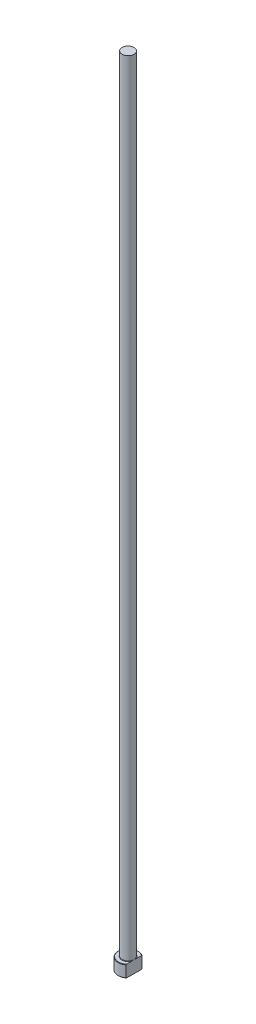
ISO-10303-21;
HEADER;
FILE_DESCRIPTION(('STEP AP214'),'2;1');
FILE_NAME('part.step','',(''),(''),'','','');
FILE_SCHEMA(('AUTOMOTIVE_DESIGN { 1 0 10303 214 1 1 1 1 }'));
ENDSEC;
DATA;
#1=APPLICATION_CONTEXT('core data for automotive mechanical design processes');
#2=APPLICATION_PROTOCOL_DEFINITION('international standard','automotive_design',2000,#1);
#3=PRODUCT_CONTEXT('',#1,'mechanical');
#4=PRODUCT('Part','Part','',(#3));
#5=PRODUCT_RELATED_PRODUCT_CATEGORY('part','',(#4));
#6=PRODUCT_DEFINITION_FORMATION('','',#4);
#7=PRODUCT_DEFINITION_CONTEXT('part definition',#1,'design');
#8=PRODUCT_DEFINITION('design','',#6,#7);
#9=PRODUCT_DEFINITION_SHAPE('','',#8);
#10=(LENGTH_UNIT() NAMED_UNIT(*) SI_UNIT(.MILLI.,.METRE.));
#11=(NAMED_UNIT(*) PLANE_ANGLE_UNIT() SI_UNIT($,.RADIAN.));
#12=(NAMED_UNIT(*) SI_UNIT($,.STERADIAN.) SOLID_ANGLE_UNIT());
#13=UNCERTAINTY_MEASURE_WITH_UNIT(LENGTH_MEASURE(1.E-05),#10,'distance_accuracy_value','');
#14=(GEOMETRIC_REPRESENTATION_CONTEXT(3) GLOBAL_UNCERTAINTY_ASSIGNED_CONTEXT((#13)) GLOBAL_UNIT_ASSIGNED_CONTEXT((#10,
#11,#12)) REPRESENTATION_CONTEXT('',''));
#15=CARTESIAN_POINT('',(0.,0.,0.));
#16=DIRECTION('',(0.,0.,1.));
#17=DIRECTION('',(1.,0.,0.));
#18=AXIS2_PLACEMENT_3D('',#15,#16,#17);
#19=CARTESIAN_POINT('',(0.,0.,0.));
#20=DIRECTION('',(0.,-1.,0.));
#21=DIRECTION('',(0.,0.,-1.));
#22=AXIS2_PLACEMENT_3D('',#19,#20,#21);
#23=PLANE('',#22);
#24=CARTESIAN_POINT('',(0.,0.,0.));
#25=DIRECTION('',(0.,-1.,0.));
#26=DIRECTION('',(0.,0.,-1.));
#27=AXIS2_PLACEMENT_3D('',#24,#25,#26);
#28=CIRCLE('',#27,4.79999999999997);
#29=CARTESIAN_POINT('',(2.99999999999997,0.,3.74699879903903));
#30=VERTEX_POINT('',#29);
#31=CARTESIAN_POINT('',(2.99999999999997,0.,-3.74699879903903));
#32=VERTEX_POINT('',#31);
#33=EDGE_CURVE('E98',#30,#32,#28,.T.);
#34=ORIENTED_EDGE('',*,*,#33,.T.);
#35=DIRECTION('',(0.,0.,1.));
#36=VECTOR('',#35,1.);
#37=CARTESIAN_POINT('',(2.99999999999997,0.,3.99999999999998));
#38=LINE('',#37,#36);
#39=EDGE_CURVE('E83',#32,#30,#38,.T.);
#40=ORIENTED_EDGE('',*,*,#39,.T.);
#41=EDGE_LOOP('',(#34,#40));
#42=FACE_BOUND('',#41,.T.);
#43=ADVANCED_FACE('F32',(#42),#23,.T.);
#44=CARTESIAN_POINT('',(0.,259.958771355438,0.));
#45=DIRECTION('',(0.,1.,0.));
#46=DIRECTION('',(0.,0.,1.));
#47=AXIS2_PLACEMENT_3D('',#44,#45,#46);
#48=CYLINDRICAL_SURFACE('',#47,4.99999999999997);
#49=CARTESIAN_POINT('',(0.,5.80000000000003,0.));
#50=DIRECTION('',(0.,1.,0.));
#51=DIRECTION('',(0.,0.,1.));
#52=AXIS2_PLACEMENT_3D('',#49,#50,#51);
#53=CIRCLE('',#52,4.99999999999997);
#54=CARTESIAN_POINT('',(2.99999999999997,5.80000000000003,3.99999999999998));
#55=VERTEX_POINT('',#54);
#56=CARTESIAN_POINT('',(2.99999999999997,5.80000000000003,-3.99999999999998));
#57=VERTEX_POINT('',#56);
#58=EDGE_CURVE('E104',#55,#57,#53,.F.);
#59=ORIENTED_EDGE('',*,*,#58,.T.);
#60=DIRECTION('',(0.,-1.,0.));
#61=VECTOR('',#60,1.);
#62=CARTESIAN_POINT('',(2.99999999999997,400.,-3.99999999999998));
#63=LINE('',#62,#61);
#64=CARTESIAN_POINT('',(2.99999999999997,0.199999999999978,-3.99999999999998));
#65=VERTEX_POINT('',#64);
#66=EDGE_CURVE('E183',#57,#65,#63,.T.);
#67=ORIENTED_EDGE('',*,*,#66,.T.);
#68=CARTESIAN_POINT('',(0.,0.199999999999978,0.));
#69=DIRECTION('',(0.,-1.,0.));
#70=DIRECTION('',(0.,0.,-1.));
#71=AXIS2_PLACEMENT_3D('',#68,#69,#70);
#72=CIRCLE('',#71,4.99999999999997);
#73=CARTESIAN_POINT('',(2.99999999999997,0.199999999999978,3.99999999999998));
#74=VERTEX_POINT('',#73);
#75=EDGE_CURVE('E100',#65,#74,#72,.F.);
#76=ORIENTED_EDGE('',*,*,#75,.T.);
#77=DIRECTION('',(0.,-1.,0.));
#78=VECTOR('',#77,1.);
#79=CARTESIAN_POINT('',(2.99999999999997,400.,3.99999999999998));
#80=LINE('',#79,#78);
#81=EDGE_CURVE('E93',#55,#74,#80,.T.);
#82=ORIENTED_EDGE('',*,*,#81,.F.);
#83=EDGE_LOOP('',(#59,#67,#76,#82));
#84=FACE_BOUND('',#83,.T.);
#85=ADVANCED_FACE('F158',(#84),#48,.T.);
#86=CARTESIAN_POINT('',(-4.99999999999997,6.,0.));
#87=DIRECTION('',(0.,1.,0.));
#88=DIRECTION('',(0.,0.,1.));
#89=AXIS2_PLACEMENT_3D('',#86,#87,#88);
#90=PLANE('',#89);
#91=CARTESIAN_POINT('',(0.,6.,0.));
#92=DIRECTION('',(0.,1.,0.));
#93=DIRECTION('',(0.,0.,1.));
#94=AXIS2_PLACEMENT_3D('',#91,#92,#93);
#95=CIRCLE('',#94,4.79999999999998);
#96=CARTESIAN_POINT('',(2.99999999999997,6.,-3.74699879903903));
#97=VERTEX_POINT('',#96);
#98=CARTESIAN_POINT('',(2.99999999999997,6.,3.74699879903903));
#99=VERTEX_POINT('',#98);
#100=EDGE_CURVE('E178',#97,#99,#95,.T.);
#101=ORIENTED_EDGE('',*,*,#100,.T.);
#102=DIRECTION('',(0.,0.,-1.));
#103=VECTOR('',#102,1.);
#104=CARTESIAN_POINT('',(2.99999999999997,6.,0.));
#105=LINE('',#104,#103);
#106=CARTESIAN_POINT('',(2.99999999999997,5.99999999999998,1.11355287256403));
#107=VERTEX_POINT('',#106);
#108=EDGE_CURVE('E57',#99,#107,#105,.T.);
#109=ORIENTED_EDGE('',*,*,#108,.T.);
#110=CARTESIAN_POINT('',(0.,6.,0.));
#111=DIRECTION('',(0.,1.,0.));
#112=DIRECTION('',(0.,0.,1.));
#113=AXIS2_PLACEMENT_3D('',#110,#111,#112);
#114=CIRCLE('',#113,3.19999999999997);
#115=CARTESIAN_POINT('',(2.99999999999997,5.99999999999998,-1.113552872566));
#116=VERTEX_POINT('',#115);
#117=EDGE_CURVE('E107',#107,#116,#114,.F.);
#118=ORIENTED_EDGE('',*,*,#117,.T.);
#119=EDGE_CURVE('E136',#116,#97,#105,.T.);
#120=ORIENTED_EDGE('',*,*,#119,.T.);
#121=EDGE_LOOP('',(#101,#109,#118,#120));
#122=FACE_BOUND('',#121,.T.);
#123=ADVANCED_FACE('F147',(#122),#90,.T.);
#124=CARTESIAN_POINT('',(0.,6.00000000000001,0.));
#125=DIRECTION('',(0.,-1.,0.));
#126=DIRECTION('',(0.,0.,-1.));
#127=AXIS2_PLACEMENT_3D('',#124,#125,#126);
#128=CONICAL_SURFACE('',#127,4.79999999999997,0.785398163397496);
#129=ORIENTED_EDGE('',*,*,#58,.F.);
#130=CARTESIAN_POINT('',(2.99999999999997,1.50107969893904,8.80169976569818));
#131=CARTESIAN_POINT('',(2.99999999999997,1.63686222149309,8.65824370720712));
#132=CARTESIAN_POINT('',(2.99999999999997,1.77246571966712,8.51461803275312));
#133=CARTESIAN_POINT('',(2.99999999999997,2.04325136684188,8.22696847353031));
#134=CARTESIAN_POINT('',(2.99999999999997,2.17843351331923,8.0829445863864));
#135=CARTESIAN_POINT('',(2.99999999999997,2.58356488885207,7.6498536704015));
#136=CARTESIAN_POINT('',(2.99999999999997,2.85278243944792,7.3601013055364));
#137=CARTESIAN_POINT('',(2.99999999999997,3.40003551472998,6.76562093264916));
#138=CARTESIAN_POINT('',(2.99999999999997,3.67795327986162,6.4607841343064));
#139=CARTESIAN_POINT('',(2.99999999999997,4.09143431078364,6.00077575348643));
#140=CARTESIAN_POINT('',(2.99999999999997,4.22862197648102,5.84706478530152));
#141=CARTESIAN_POINT('',(2.99999999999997,4.50164803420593,5.5384501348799));
#142=CARTESIAN_POINT('',(2.99999999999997,4.63748643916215,5.38354646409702));
#143=CARTESIAN_POINT('',(2.99999999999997,4.90727601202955,5.07249257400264));
#144=CARTESIAN_POINT('',(2.99999999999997,5.04122961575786,4.91634447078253));
#145=CARTESIAN_POINT('',(2.99999999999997,5.30697993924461,4.60220522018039));
#146=CARTESIAN_POINT('',(2.99999999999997,5.43877654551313,4.44421397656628));
#147=CARTESIAN_POINT('',(2.99999999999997,5.69999683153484,4.12534042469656));
#148=CARTESIAN_POINT('',(2.99999999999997,5.82941047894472,3.96444987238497));
#149=CARTESIAN_POINT('',(2.99999999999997,6.0843825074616,3.63966784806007));
#150=CARTESIAN_POINT('',(2.99999999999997,6.20994148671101,3.4757768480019));
#151=CARTESIAN_POINT('',(2.99999999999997,6.45325581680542,3.1473981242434));
#152=CARTESIAN_POINT('',(2.99999999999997,6.57111776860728,2.98298986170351));
#153=CARTESIAN_POINT('',(2.99999999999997,6.79968625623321,2.64903166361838));
#154=CARTESIAN_POINT('',(2.99999999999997,6.91038738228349,2.47947797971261));
#155=CARTESIAN_POINT('',(2.99999999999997,7.12046597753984,2.13484547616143));
#156=CARTESIAN_POINT('',(2.99999999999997,7.21990868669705,1.95980688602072));
#157=CARTESIAN_POINT('',(2.99999999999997,7.4027173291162,1.60161809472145));
#158=CARTESIAN_POINT('',(2.99999999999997,7.48611382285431,1.41848414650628));
#159=CARTESIAN_POINT('',(2.99999999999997,7.59087391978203,1.14242184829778));
#160=CARTESIAN_POINT('',(2.99999999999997,7.62169870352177,1.05308812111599));
#161=CARTESIAN_POINT('',(2.99999999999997,7.67691431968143,0.87239308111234));
#162=CARTESIAN_POINT('',(2.99999999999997,7.70130307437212,0.781031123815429));
#163=CARTESIAN_POINT('',(2.99999999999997,7.7424594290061,0.597105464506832));
#164=CARTESIAN_POINT('',(2.99999999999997,7.75926776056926,0.504551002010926));
#165=CARTESIAN_POINT('',(2.99999999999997,7.78456917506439,0.318316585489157));
#166=CARTESIAN_POINT('',(2.99999999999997,7.79306431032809,0.224636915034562));
#167=CARTESIAN_POINT('',(2.99999999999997,7.80126723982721,0.0362345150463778));
#168=CARTESIAN_POINT('',(2.99999999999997,7.80091364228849,-0.0584909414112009));
#169=CARTESIAN_POINT('',(2.99999999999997,7.79128992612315,-0.247479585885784));
#170=CARTESIAN_POINT('',(2.99999999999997,7.78201974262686,-0.341742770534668));
#171=CARTESIAN_POINT('',(2.99999999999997,7.75505711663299,-0.529484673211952));
#172=CARTESIAN_POINT('',(2.99999999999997,7.7373257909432,-0.622957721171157));
#173=CARTESIAN_POINT('',(2.99999999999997,7.69436193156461,-0.808152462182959));
#174=CARTESIAN_POINT('',(2.99999999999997,7.66912783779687,-0.899873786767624));
#175=CARTESIAN_POINT('',(2.99999999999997,7.59536615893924,-1.13513447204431));
#176=CARTESIAN_POINT('',(2.99999999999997,7.54190202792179,-1.27712290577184));
#177=CARTESIAN_POINT('',(2.99999999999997,7.42288064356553,-1.55591594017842));
#178=CARTESIAN_POINT('',(2.99999999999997,7.3573134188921,-1.69271615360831));
#179=CARTESIAN_POINT('',(2.99999999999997,7.216730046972,-1.96297343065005));
#180=CARTESIAN_POINT('',(2.99999999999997,7.14163008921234,-2.09638641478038));
#181=CARTESIAN_POINT('',(2.99999999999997,7.02409885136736,-2.29351148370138));
#182=CARTESIAN_POINT('',(2.99999999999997,6.98411579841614,-2.35870939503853));
#183=CARTESIAN_POINT('',(2.99999999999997,6.90273519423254,-2.48821412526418));
#184=CARTESIAN_POINT('',(2.99999999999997,6.86133769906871,-2.55252097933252));
#185=CARTESIAN_POINT('',(2.99999999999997,6.72108058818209,-2.7659208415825));
#186=CARTESIAN_POINT('',(2.99999999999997,6.61950942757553,-2.91323263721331));
#187=CARTESIAN_POINT('',(2.99999999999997,6.41158682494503,-3.20445576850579));
#188=CARTESIAN_POINT('',(2.99999999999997,6.30523434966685,-3.3483663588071));
#189=CARTESIAN_POINT('',(2.99999999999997,6.08891481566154,-3.63358820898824));
#190=CARTESIAN_POINT('',(2.99999999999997,5.97894537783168,-3.77489765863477));
#191=CARTESIAN_POINT('',(2.99999999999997,5.75630759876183,-4.05537908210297));
#192=CARTESIAN_POINT('',(2.99999999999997,5.6436391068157,-4.19455093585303));
#193=CARTESIAN_POINT('',(2.99999999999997,5.41585487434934,-4.47160548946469));
#194=CARTESIAN_POINT('',(2.99999999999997,5.3007325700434,-4.6094827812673));
#195=CARTESIAN_POINT('',(2.99999999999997,5.06881951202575,-4.88382857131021));
#196=CARTESIAN_POINT('',(2.99999999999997,4.95202872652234,-5.02029704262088));
#197=CARTESIAN_POINT('',(2.99999999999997,4.59976429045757,-5.42786401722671));
#198=CARTESIAN_POINT('',(2.99999999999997,4.36230070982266,-5.69724186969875));
#199=CARTESIAN_POINT('',(2.99999999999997,3.90791057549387,-6.20584337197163));
#200=CARTESIAN_POINT('',(2.99999999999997,3.6913237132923,-6.4453721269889));
#201=CARTESIAN_POINT('',(2.99999999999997,3.25600753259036,-6.92252604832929));
#202=CARTESIAN_POINT('',(2.99999999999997,3.03727796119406,-7.16015098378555));
#203=CARTESIAN_POINT('',(2.99999999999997,2.59963438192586,-7.63242038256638));
#204=CARTESIAN_POINT('',(2.99999999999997,2.38073043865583,-7.86707418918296));
#205=CARTESIAN_POINT('',(2.99999999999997,1.94172655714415,-8.33519393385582));
#206=CARTESIAN_POINT('',(2.99999999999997,1.72162680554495,-8.56866004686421));
#207=CARTESIAN_POINT('',(2.99999999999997,1.50107969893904,-8.80169976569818));
#208=B_SPLINE_CURVE_WITH_KNOTS('',3,(#130,#131,#132,#133,#134,#135,#136,#137,#138,#139,#140,
#141,#142,#143,#144,#145,#146,#147,#148,#149,#150,#151,#152,#153,#154,#155,#156,#157,#158,#159,
#160,#161,#162,#163,#164,#165,#166,#167,#168,#169,#170,#171,#172,#173,#174,#175,#176,#177,#178,
#179,#180,#181,#182,#183,#184,#185,#186,#187,#188,#189,#190,#191,#192,#193,#194,#195,#196,#197,
#198,#199,#200,#201,#202,#203,#204,#205,#206,#207),.UNSPECIFIED.,.F.,.F.,(4,2,2,2,2,2,2,2,2,2,2,
2,2,2,2,2,2,2,2,2,2,2,2,2,2,2,2,2,2,2,2,2,2,2,2,2,2,2,4),(0.,0.5925780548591,1.18515965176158,
2.37170329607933,3.60919781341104,4.22727570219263,4.84534766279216,5.46252965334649,
6.07974401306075,6.69913968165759,7.31843874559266,7.92518229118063,8.53237898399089,
9.135854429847,9.73816890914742,10.0214813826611,10.3048852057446,10.5867475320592,
10.8685402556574,11.152288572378,11.436038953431,11.7211060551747,12.0062324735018,
12.4605654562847,12.9152744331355,13.3743011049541,13.6037325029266,13.8331548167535,
14.3698070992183,14.9065759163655,15.4437051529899,15.9808644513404,16.5197074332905,
17.0585606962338,18.1358079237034,19.1045853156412,20.0734784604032,21.0361950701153,
21.9987655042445),.UNSPECIFIED.);
#209=EDGE_CURVE('E135',#55,#99,#208,.T.);
#210=ORIENTED_EDGE('',*,*,#209,.T.);
#211=ORIENTED_EDGE('',*,*,#100,.F.);
#212=EDGE_CURVE('E127',#97,#57,#208,.T.);
#213=ORIENTED_EDGE('',*,*,#212,.T.);
#214=EDGE_LOOP('',(#129,#210,#211,#213));
#215=FACE_BOUND('',#214,.T.);
#216=ADVANCED_FACE('F143',(#215),#128,.T.);
#217=CARTESIAN_POINT('',(0.,0.199999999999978,0.));
#218=DIRECTION('',(0.,1.,0.));
#219=DIRECTION('',(0.,0.,1.));
#220=AXIS2_PLACEMENT_3D('',#217,#218,#219);
#221=CONICAL_SURFACE('',#220,4.99999999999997,0.785398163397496);
#222=ORIENTED_EDGE('',*,*,#75,.F.);
#223=CARTESIAN_POINT('',(2.99999999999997,4.49892030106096,-8.80169976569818));
#224=CARTESIAN_POINT('',(2.99999999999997,4.36313777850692,-8.65824370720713));
#225=CARTESIAN_POINT('',(2.99999999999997,4.22753428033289,-8.51461803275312));
#226=CARTESIAN_POINT('',(2.99999999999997,3.95674863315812,-8.22696847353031));
#227=CARTESIAN_POINT('',(2.99999999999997,3.82156648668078,-8.0829445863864));
#228=CARTESIAN_POINT('',(2.99999999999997,3.41643511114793,-7.6498536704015));
#229=CARTESIAN_POINT('',(2.99999999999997,3.14721756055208,-7.3601013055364));
#230=CARTESIAN_POINT('',(2.99999999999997,2.59996448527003,-6.76562093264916));
#231=CARTESIAN_POINT('',(2.99999999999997,2.32204672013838,-6.4607841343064));
#232=CARTESIAN_POINT('',(2.99999999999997,1.90856568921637,-6.00077575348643));
#233=CARTESIAN_POINT('',(2.99999999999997,1.77137802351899,-5.84706478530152));
#234=CARTESIAN_POINT('',(2.99999999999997,1.49835196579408,-5.5384501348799));
#235=CARTESIAN_POINT('',(2.99999999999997,1.36251356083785,-5.38354646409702));
#236=CARTESIAN_POINT('',(2.99999999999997,1.09272398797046,-5.07249257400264));
#237=CARTESIAN_POINT('',(2.99999999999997,0.958770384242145,-4.91634447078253));
#238=CARTESIAN_POINT('',(2.99999999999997,0.693020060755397,-4.60220522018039));
#239=CARTESIAN_POINT('',(2.99999999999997,0.561223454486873,-4.44421397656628));
#240=CARTESIAN_POINT('',(2.99999999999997,0.300003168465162,-4.12534042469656));
#241=CARTESIAN_POINT('',(2.99999999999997,0.170589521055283,-3.96444987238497));
#242=CARTESIAN_POINT('',(2.99999999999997,-0.0843825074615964,-3.63966784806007));
#243=CARTESIAN_POINT('',(2.99999999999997,-0.209941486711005,-3.4757768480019));
#244=CARTESIAN_POINT('',(2.99999999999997,-0.453255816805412,-3.1473981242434));
#245=CARTESIAN_POINT('',(2.99999999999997,-0.571117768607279,-2.9829898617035));
#246=CARTESIAN_POINT('',(2.99999999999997,-0.799686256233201,-2.64903166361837));
#247=CARTESIAN_POINT('',(2.99999999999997,-0.910387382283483,-2.47947797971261));
#248=CARTESIAN_POINT('',(2.99999999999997,-1.12046597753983,-2.13484547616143));
#249=CARTESIAN_POINT('',(2.99999999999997,-1.21990868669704,-1.95980688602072));
#250=CARTESIAN_POINT('',(2.99999999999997,-1.40271732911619,-1.60161809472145));
#251=CARTESIAN_POINT('',(2.99999999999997,-1.48611382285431,-1.41848414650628));
#252=CARTESIAN_POINT('',(2.99999999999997,-1.59087391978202,-1.14242184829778));
#253=CARTESIAN_POINT('',(2.99999999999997,-1.62169870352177,-1.05308812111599));
#254=CARTESIAN_POINT('',(2.99999999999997,-1.67691431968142,-0.872393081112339));
#255=CARTESIAN_POINT('',(2.99999999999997,-1.70130307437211,-0.781031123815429));
#256=CARTESIAN_POINT('',(2.99999999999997,-1.7424594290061,-0.597105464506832));
#257=CARTESIAN_POINT('',(2.99999999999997,-1.75926776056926,-0.504551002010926));
#258=CARTESIAN_POINT('',(2.99999999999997,-1.78456917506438,-0.318316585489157));
#259=CARTESIAN_POINT('',(2.99999999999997,-1.79306431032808,-0.224636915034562));
#260=CARTESIAN_POINT('',(2.99999999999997,-1.8012672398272,-0.0362345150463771));
#261=CARTESIAN_POINT('',(2.99999999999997,-1.80091364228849,0.0584909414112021));
#262=CARTESIAN_POINT('',(2.99999999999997,-1.79128992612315,0.247479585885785));
#263=CARTESIAN_POINT('',(2.99999999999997,-1.78201974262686,0.341742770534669));
#264=CARTESIAN_POINT('',(2.99999999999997,-1.75505711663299,0.529484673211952));
#265=CARTESIAN_POINT('',(2.99999999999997,-1.7373257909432,0.622957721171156));
#266=CARTESIAN_POINT('',(2.99999999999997,-1.6943619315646,0.808152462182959));
#267=CARTESIAN_POINT('',(2.99999999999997,-1.66912783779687,0.899873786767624));
#268=CARTESIAN_POINT('',(2.99999999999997,-1.59536615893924,1.13513447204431));
#269=CARTESIAN_POINT('',(2.99999999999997,-1.54190202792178,1.27712290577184));
#270=CARTESIAN_POINT('',(2.99999999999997,-1.42288064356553,1.55591594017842));
#271=CARTESIAN_POINT('',(2.99999999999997,-1.3573134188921,1.69271615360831));
#272=CARTESIAN_POINT('',(2.99999999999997,-1.21673004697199,1.96297343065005));
#273=CARTESIAN_POINT('',(2.99999999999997,-1.14163008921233,2.09638641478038));
#274=CARTESIAN_POINT('',(2.99999999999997,-1.02409885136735,2.29351148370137));
#275=CARTESIAN_POINT('',(2.99999999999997,-0.984115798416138,2.35870939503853));
#276=CARTESIAN_POINT('',(2.99999999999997,-0.902735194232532,2.48821412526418));
#277=CARTESIAN_POINT('',(2.99999999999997,-0.861337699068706,2.55252097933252));
#278=CARTESIAN_POINT('',(2.99999999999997,-0.721080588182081,2.7659208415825));
#279=CARTESIAN_POINT('',(2.99999999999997,-0.61950942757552,2.91323263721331));
#280=CARTESIAN_POINT('',(2.99999999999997,-0.411586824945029,3.20445576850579));
#281=CARTESIAN_POINT('',(2.99999999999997,-0.305234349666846,3.3483663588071));
#282=CARTESIAN_POINT('',(2.99999999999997,-0.0889148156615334,3.63358820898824));
#283=CARTESIAN_POINT('',(2.99999999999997,0.0210546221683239,3.77489765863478));
#284=CARTESIAN_POINT('',(2.99999999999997,0.243692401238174,4.05537908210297));
#285=CARTESIAN_POINT('',(2.99999999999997,0.356360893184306,4.19455093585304));
#286=CARTESIAN_POINT('',(2.99999999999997,0.584145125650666,4.47160548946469));
#287=CARTESIAN_POINT('',(2.99999999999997,0.699267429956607,4.6094827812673));
#288=CARTESIAN_POINT('',(2.99999999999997,0.93118048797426,4.88382857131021));
#289=CARTESIAN_POINT('',(2.99999999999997,1.04797127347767,5.02029704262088));
#290=CARTESIAN_POINT('',(2.99999999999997,1.40023570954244,5.42786401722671));
#291=CARTESIAN_POINT('',(2.99999999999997,1.63769929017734,5.69724186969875));
#292=CARTESIAN_POINT('',(2.99999999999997,2.09208942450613,6.20584337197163));
#293=CARTESIAN_POINT('',(2.99999999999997,2.3086762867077,6.4453721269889));
#294=CARTESIAN_POINT('',(2.99999999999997,2.74399246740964,6.92252604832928));
#295=CARTESIAN_POINT('',(2.99999999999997,2.96272203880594,7.16015098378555));
#296=CARTESIAN_POINT('',(2.99999999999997,3.40036561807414,7.63242038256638));
#297=CARTESIAN_POINT('',(2.99999999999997,3.61926956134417,7.86707418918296));
#298=CARTESIAN_POINT('',(2.99999999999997,4.05827344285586,8.33519393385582));
#299=CARTESIAN_POINT('',(2.99999999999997,4.27837319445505,8.56866004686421));
#300=CARTESIAN_POINT('',(2.99999999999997,4.49892030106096,8.80169976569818));
#301=B_SPLINE_CURVE_WITH_KNOTS('',3,(#223,#224,#225,#226,#227,#228,#229,#230,#231,#232,#233,
#234,#235,#236,#237,#238,#239,#240,#241,#242,#243,#244,#245,#246,#247,#248,#249,#250,#251,#252,
#253,#254,#255,#256,#257,#258,#259,#260,#261,#262,#263,#264,#265,#266,#267,#268,#269,#270,#271,
#272,#273,#274,#275,#276,#277,#278,#279,#280,#281,#282,#283,#284,#285,#286,#287,#288,#289,#290,
#291,#292,#293,#294,#295,#296,#297,#298,#299,#300),.UNSPECIFIED.,.F.,.F.,(4,2,2,2,2,2,2,2,2,2,2,
2,2,2,2,2,2,2,2,2,2,2,2,2,2,2,2,2,2,2,2,2,2,2,2,2,2,2,4),(0.,0.592578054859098,1.18515965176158,
2.37170329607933,3.60919781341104,4.22727570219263,4.84534766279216,5.46252965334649,
6.07974401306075,6.6991396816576,7.31843874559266,7.92518229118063,8.53237898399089,
9.135854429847,9.73816890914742,10.0214813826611,10.3048852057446,10.5867475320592,
10.8685402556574,11.152288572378,11.436038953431,11.7211060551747,12.0062324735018,
12.4605654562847,12.9152744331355,13.3743011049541,13.6037325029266,13.8331548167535,
14.3698070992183,14.9065759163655,15.4437051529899,15.9808644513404,16.5197074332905,
17.0585606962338,18.1358079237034,19.1045853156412,20.0734784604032,21.0361950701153,
21.9987655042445),.UNSPECIFIED.);
#302=EDGE_CURVE('E86',#65,#32,#301,.T.);
#303=ORIENTED_EDGE('',*,*,#302,.T.);
#304=ORIENTED_EDGE('',*,*,#33,.F.);
#305=EDGE_CURVE('E89',#30,#74,#301,.T.);
#306=ORIENTED_EDGE('',*,*,#305,.T.);
#307=EDGE_LOOP('',(#222,#303,#304,#306));
#308=FACE_BOUND('',#307,.T.);
#309=ADVANCED_FACE('F97',(#308),#221,.T.);
#310=CARTESIAN_POINT('',(0.,6.19999999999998,0.));
#311=DIRECTION('',(0.,1.,0.));
#312=DIRECTION('',(0.,0.,1.));
#313=AXIS2_PLACEMENT_3D('',#310,#311,#312);
#314=TOROIDAL_SURFACE('',#313,3.19999999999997,0.2);
#315=CARTESIAN_POINT('',(2.99999999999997,6.19999999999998,0.));
#316=CARTESIAN_POINT('',(2.99999999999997,6.20000054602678,-8.25590029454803E-09));
#317=CARTESIAN_POINT('',(2.99999999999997,6.20000108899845,-2.22623717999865E-07));
#318=CARTESIAN_POINT('',(2.99999999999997,6.20000210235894,-8.13181332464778E-07));
#319=CARTESIAN_POINT('',(2.99999999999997,6.20000256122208,-1.20262210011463E-06));
#320=CARTESIAN_POINT('',(2.99999999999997,6.20000351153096,-2.13233194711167E-06));
#321=CARTESIAN_POINT('',(2.99999999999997,6.20000398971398,-2.68711080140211E-06));
#322=CARTESIAN_POINT('',(2.99999999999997,6.20000484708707,-3.8372299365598E-06));
#323=CARTESIAN_POINT('',(2.99999999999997,6.20000522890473,-4.43075975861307E-06));
#324=CARTESIAN_POINT('',(2.99999999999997,6.20000663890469,-6.718054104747E-06));
#325=CARTESIAN_POINT('',(2.99999999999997,6.20000758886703,-8.46267334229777E-06));
#326=CARTESIAN_POINT('',(2.99999999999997,6.20000915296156,-1.19195939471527E-05));
#327=CARTESIAN_POINT('',(2.99999999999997,6.20000978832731,-1.36226968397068E-05));
#328=CARTESIAN_POINT('',(2.99999999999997,6.20001243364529,-2.07785329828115E-05));
#329=CARTESIAN_POINT('',(2.99999999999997,6.20001439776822,-2.62512689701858E-05));
#330=CARTESIAN_POINT('',(2.99999999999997,6.20001730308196,-3.65971254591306E-05));
#331=CARTESIAN_POINT('',(2.99999999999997,6.20001835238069,-4.14397204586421E-05));
#332=CARTESIAN_POINT('',(2.99999999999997,6.20002589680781,-7.68826112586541E-05));
#333=CARTESIAN_POINT('',(2.99999999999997,6.20003169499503,-0.000107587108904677));
#334=CARTESIAN_POINT('',(2.99999999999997,6.20005649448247,-0.000225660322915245));
#335=CARTESIAN_POINT('',(2.99999999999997,6.20007997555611,-0.000312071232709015));
#336=CARTESIAN_POINT('',(2.99999999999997,6.20016717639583,-0.00063874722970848));
#337=CARTESIAN_POINT('',(2.99999999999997,6.20022823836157,-0.00087949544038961));
#338=CARTESIAN_POINT('',(2.99999999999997,6.20046253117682,-0.00179757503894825));
#339=CARTESIAN_POINT('',(2.99999999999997,6.20063826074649,-0.00247448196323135));
#340=CARTESIAN_POINT('',(2.99999999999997,6.20145771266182,-0.00563611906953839));
#341=CARTESIAN_POINT('',(2.99999999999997,6.20209802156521,-0.00812138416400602));
#342=CARTESIAN_POINT('',(2.99999999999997,6.20747052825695,-0.0289666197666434));
#343=CARTESIAN_POINT('',(2.99999999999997,6.21221441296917,-0.0473249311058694));
#344=CARTESIAN_POINT('',(2.99999999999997,6.22150414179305,-0.0833908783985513));
#345=CARTESIAN_POINT('',(2.99999999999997,6.22605099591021,-0.101098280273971));
#346=CARTESIAN_POINT('',(2.99999999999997,6.24071513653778,-0.158441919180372));
#347=CARTESIAN_POINT('',(2.99999999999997,6.25076238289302,-0.198096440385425));
#348=CARTESIAN_POINT('',(2.99999999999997,6.2673587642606,-0.264903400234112));
#349=CARTESIAN_POINT('',(2.99999999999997,6.27400650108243,-0.292031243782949));
#350=CARTESIAN_POINT('',(2.99999999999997,6.28691139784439,-0.345693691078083));
#351=CARTESIAN_POINT('',(2.99999999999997,6.2931740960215,-0.372226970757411));
#352=CARTESIAN_POINT('',(2.99999999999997,6.31359314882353,-0.460847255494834));
#353=CARTESIAN_POINT('',(2.99999999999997,6.32711949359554,-0.523084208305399));
#354=CARTESIAN_POINT('',(2.99999999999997,6.35185224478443,-0.648627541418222));
#355=CARTESIAN_POINT('',(2.99999999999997,6.36303576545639,-0.711938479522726));
#356=CARTESIAN_POINT('',(2.99999999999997,6.38269719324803,-0.845442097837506));
#357=CARTESIAN_POINT('',(2.99999999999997,6.39079783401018,-0.915695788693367));
#358=CARTESIAN_POINT('',(2.99999999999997,6.39788104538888,-1.02128246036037));
#359=CARTESIAN_POINT('',(2.99999999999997,6.39939945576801,-1.05644278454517));
#360=CARTESIAN_POINT('',(2.99999999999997,6.40031405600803,-1.12678521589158));
#361=CARTESIAN_POINT('',(2.99999999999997,6.39971158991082,-1.16196729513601));
#362=CARTESIAN_POINT('',(2.99999999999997,6.39660553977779,-1.21713951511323));
#363=CARTESIAN_POINT('',(2.99999999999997,6.39502683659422,-1.23718181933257));
#364=CARTESIAN_POINT('',(2.99999999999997,6.39080008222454,-1.27717351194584));
#365=CARTESIAN_POINT('',(2.99999999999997,6.38815120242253,-1.29712281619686));
#366=CARTESIAN_POINT('',(2.99999999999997,6.38160570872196,-1.33655702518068));
#367=CARTESIAN_POINT('',(2.99999999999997,6.37772556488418,-1.35604460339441));
#368=CARTESIAN_POINT('',(2.99999999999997,6.36841119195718,-1.39463554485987));
#369=CARTESIAN_POINT('',(2.99999999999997,6.36297874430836,-1.41373932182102));
#370=CARTESIAN_POINT('',(2.99999999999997,6.3500393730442,-1.45151809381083));
#371=CARTESIAN_POINT('',(2.99999999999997,6.34250654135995,-1.4701843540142));
#372=CARTESIAN_POINT('',(2.99999999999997,6.32469433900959,-1.50617232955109));
#373=CARTESIAN_POINT('',(2.99999999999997,6.31442814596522,-1.52349999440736));
#374=CARTESIAN_POINT('',(2.99999999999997,6.29768486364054,-1.5453003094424));
#375=CARTESIAN_POINT('',(2.99999999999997,6.29285641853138,-1.551032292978));
#376=CARTESIAN_POINT('',(2.99999999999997,6.28257691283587,-1.56192749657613));
#377=CARTESIAN_POINT('',(2.99999999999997,6.27712536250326,-1.56709026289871));
#378=CARTESIAN_POINT('',(2.99999999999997,6.26548354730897,-1.57666725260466));
#379=CARTESIAN_POINT('',(2.99999999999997,6.25928560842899,-1.58107232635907));
#380=CARTESIAN_POINT('',(2.99999999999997,6.24620912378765,-1.5887219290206));
#381=CARTESIAN_POINT('',(2.99999999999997,6.23933242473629,-1.59196950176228));
#382=CARTESIAN_POINT('',(2.99999999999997,6.2270240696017,-1.5962468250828));
#383=CARTESIAN_POINT('',(2.99999999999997,6.2217197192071,-1.59764171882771));
#384=CARTESIAN_POINT('',(2.99999999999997,6.2109516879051,-1.59951721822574));
#385=CARTESIAN_POINT('',(2.99999999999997,6.20548813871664,-1.59999855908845));
#386=CARTESIAN_POINT('',(2.99999999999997,6.19455397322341,-1.60000143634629));
#387=CARTESIAN_POINT('',(2.99999999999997,6.18908335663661,-1.59952177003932));
#388=CARTESIAN_POINT('',(2.99999999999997,6.17830149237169,-1.59764696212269));
#389=CARTESIAN_POINT('',(2.99999999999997,6.17299036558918,-1.59625114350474));
#390=CARTESIAN_POINT('',(2.99999999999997,6.16137413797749,-1.5922159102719));
#391=CARTESIAN_POINT('',(2.99999999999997,6.15514663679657,-1.58935479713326));
#392=CARTESIAN_POINT('',(2.99999999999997,6.14323789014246,-1.58266473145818));
#393=CARTESIAN_POINT('',(2.99999999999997,6.13755768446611,-1.57883398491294));
#394=CARTESIAN_POINT('',(2.99999999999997,6.12388989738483,-1.5682309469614));
#395=CARTESIAN_POINT('',(2.99999999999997,6.11627920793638,-1.5609769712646));
#396=CARTESIAN_POINT('',(2.99999999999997,6.10222993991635,-1.54541986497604));
#397=CARTESIAN_POINT('',(2.99999999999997,6.09579438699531,-1.53711411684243));
#398=CARTESIAN_POINT('',(2.99999999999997,6.07874447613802,-1.51234359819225));
#399=CARTESIAN_POINT('',(2.99999999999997,6.06934681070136,-1.49505024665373));
#400=CARTESIAN_POINT('',(2.99999999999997,6.05300413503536,-1.45936637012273));
#401=CARTESIAN_POINT('',(2.99999999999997,6.04606563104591,-1.44097308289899));
#402=CARTESIAN_POINT('',(2.99999999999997,6.03343712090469,-1.40170303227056));
#403=CARTESIAN_POINT('',(2.99999999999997,6.02794514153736,-1.38076360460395));
#404=CARTESIAN_POINT('',(2.99999999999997,6.01869119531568,-1.33849708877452));
#405=CARTESIAN_POINT('',(2.99999999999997,6.01493126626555,-1.31716957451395));
#406=CARTESIAN_POINT('',(2.99999999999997,6.00879575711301,-1.27427301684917));
#407=CARTESIAN_POINT('',(2.99999999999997,6.0064232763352,-1.25270354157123));
#408=CARTESIAN_POINT('',(2.99999999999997,6.00283272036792,-1.2094871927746));
#409=CARTESIAN_POINT('',(2.99999999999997,6.00161392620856,-1.18784037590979));
#410=CARTESIAN_POINT('',(2.99999999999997,5.99921193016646,-1.11739576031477));
#411=CARTESIAN_POINT('',(2.99999999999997,5.99998309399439,-1.06853061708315));
#412=CARTESIAN_POINT('',(2.99999999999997,6.0049845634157,-0.970964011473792));
#413=CARTESIAN_POINT('',(2.99999999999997,6.00921876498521,-0.922262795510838));
#414=CARTESIAN_POINT('',(2.99999999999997,6.02027934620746,-0.825023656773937));
#415=CARTESIAN_POINT('',(2.99999999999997,6.02711306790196,-0.776486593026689));
#416=CARTESIAN_POINT('',(2.99999999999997,6.04272509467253,-0.679720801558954));
#417=CARTESIAN_POINT('',(2.99999999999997,6.05150395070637,-0.631492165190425));
#418=CARTESIAN_POINT('',(2.99999999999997,6.07999589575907,-0.487173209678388));
#419=CARTESIAN_POINT('',(2.99999999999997,6.10185558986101,-0.39151417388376));
#420=CARTESIAN_POINT('',(2.99999999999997,6.14819769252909,-0.200831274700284));
#421=CARTESIAN_POINT('',(2.99999999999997,6.17268119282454,-0.105807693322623));
#422=CARTESIAN_POINT('',(2.99999999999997,6.19722910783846,-0.01073189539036));
#423=CARTESIAN_POINT('',(2.99999999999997,6.1972452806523,-0.0106692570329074));
#424=CARTESIAN_POINT('',(2.99999999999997,6.19781243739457,-0.00847232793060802));
#425=CARTESIAN_POINT('',(2.99999999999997,6.19836102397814,-0.00633759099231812));
#426=CARTESIAN_POINT('',(2.99999999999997,6.19915976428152,-0.00325873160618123));
#427=CARTESIAN_POINT('',(2.99999999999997,6.19940591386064,-0.0023138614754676));
#428=CARTESIAN_POINT('',(2.99999999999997,6.19972567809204,-0.00105818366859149));
#429=CARTESIAN_POINT('',(2.99999999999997,6.1998040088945,-0.000748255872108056));
#430=CARTESIAN_POINT('',(2.99999999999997,6.19991224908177,-0.0003408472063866));
#431=CARTESIAN_POINT('',(2.99999999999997,6.19993871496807,-0.000242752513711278));
#432=CARTESIAN_POINT('',(2.99999999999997,6.1999662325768,-0.000111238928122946));
#433=CARTESIAN_POINT('',(2.99999999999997,6.19997237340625,-7.8903777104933E-05));
#434=CARTESIAN_POINT('',(2.99999999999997,6.19998062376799,-4.17973013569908E-05));
#435=CARTESIAN_POINT('',(2.99999999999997,6.1999817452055,-3.68646326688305E-05));
#436=CARTESIAN_POINT('',(2.99999999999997,6.19998486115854,-2.63337098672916E-05));
#437=CARTESIAN_POINT('',(2.99999999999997,6.19998697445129,-2.07707790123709E-05));
#438=CARTESIAN_POINT('',(2.99999999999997,6.19998981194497,-1.35213137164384E-05));
#439=CARTESIAN_POINT('',(2.99999999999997,6.19999048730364,-1.18115060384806E-05));
#440=CARTESIAN_POINT('',(2.99999999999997,6.19999214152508,-8.34771964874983E-06));
#441=CARTESIAN_POINT('',(2.99999999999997,6.19999314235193,-6.60378872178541E-06));
#442=CARTESIAN_POINT('',(2.99999999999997,6.19999462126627,-4.32501646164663E-06));
#443=CARTESIAN_POINT('',(2.99999999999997,6.19999502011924,-3.73587510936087E-06));
#444=CARTESIAN_POINT('',(2.99999999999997,6.19999591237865,-2.59760769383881E-06));
#445=CARTESIAN_POINT('',(2.99999999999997,6.19999640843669,-2.05040430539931E-06));
#446=CARTESIAN_POINT('',(2.99999999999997,6.19999738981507,-1.1384674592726E-06));
#447=CARTESIAN_POINT('',(2.99999999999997,6.1999978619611,-7.58552555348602E-07));
#448=CARTESIAN_POINT('',(2.99999999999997,6.19999889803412,-1.92079007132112E-07));
#449=CARTESIAN_POINT('',(2.99999999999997,6.19999945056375,8.30745072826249E-09));
#450=CARTESIAN_POINT('',(2.99999999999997,6.19999999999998,0.));
#451=B_SPLINE_CURVE_WITH_KNOTS('',3,(#315,#316,#317,#318,#319,#320,#321,#322,#323,#324,#325,
#326,#327,#328,#329,#330,#331,#332,#333,#334,#335,#336,#337,#338,#339,#340,#341,#342,#343,#344,
#345,#346,#347,#348,#349,#350,#351,#352,#353,#354,#355,#356,#357,#358,#359,#360,#361,#362,#363,
#364,#365,#366,#367,#368,#369,#370,#371,#372,#373,#374,#375,#376,#377,#378,#379,#380,#381,#382,
#383,#384,#385,#386,#387,#388,#389,#390,#391,#392,#393,#394,#395,#396,#397,#398,#399,#400,#401,
#402,#403,#404,#405,#406,#407,#408,#409,#410,#411,#412,#413,#414,#415,#416,#417,#418,#419,#420,
#421,#422,#423,#424,#425,#426,#427,#428,#429,#430,#431,#432,#433,#434,#435,#436,#437,#438,#439,
#440,#441,#442,#443,#444,#445,#446,#447,#448,#449,#450),.UNSPECIFIED.,.T.,.F.,(4,2,2,2,2,2,2,2,
2,2,2,2,2,2,2,2,2,2,2,2,2,2,2,2,2,2,2,2,2,2,2,2,2,2,2,2,2,2,2,2,2,2,2,2,2,2,2,2,2,2,2,2,2,2,2,2,
2,2,2,2,2,2,2,2,2,2,2,4),(0.,1.65204690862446E-06,3.45848791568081E-06,5.64280248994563E-06,
7.75882419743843E-06,1.36969709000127E-05,1.91454439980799E-05,3.65603921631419E-05,
5.14083081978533E-05,0.000145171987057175,0.00041354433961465,0.00115890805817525,
0.00325667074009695,0.0109563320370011,0.0678386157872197,0.12268455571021,0.245405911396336,
0.329196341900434,0.410983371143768,0.602016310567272,0.794836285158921,1.0067376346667,
1.11227258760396,1.21774067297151,1.27803175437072,1.33836960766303,1.39793215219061,
1.45742661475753,1.51769013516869,1.57766822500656,1.60011625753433,1.62258205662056,
1.64530254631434,1.66796284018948,1.68434680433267,1.70071757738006,1.71710885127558,
1.7335122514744,1.75395806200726,1.77444198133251,1.8058056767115,1.83724902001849,
1.89596356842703,1.95483231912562,2.01967230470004,2.08458838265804,2.14964892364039,
2.21466889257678,2.36107995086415,2.50765595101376,2.65464904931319,2.8016838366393,
3.09594779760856,3.39033467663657,3.39052875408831,3.39714155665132,3.40007033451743,
3.40102967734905,3.40133420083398,3.40143296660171,3.40144812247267,3.4014659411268,
3.40147145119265,3.40147746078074,3.40147959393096,3.40148179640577,3.40148361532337,
3.40148527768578),.UNSPECIFIED.);
#452=CARTESIAN_POINT('',(2.99999999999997,6.19999999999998,0.));
#453=VERTEX_POINT('',#452);
#454=EDGE_CURVE('E11',#116,#453,#451,.T.);
#455=ORIENTED_EDGE('',*,*,#454,.F.);
#456=ORIENTED_EDGE('',*,*,#117,.F.);
#457=CARTESIAN_POINT('',(2.99999999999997,6.19999999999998,0.));
#458=CARTESIAN_POINT('',(2.99999999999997,6.19999945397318,8.25590052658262E-09));
#459=CARTESIAN_POINT('',(2.99999999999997,6.19999891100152,2.22623718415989E-07));
#460=CARTESIAN_POINT('',(2.99999999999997,6.19999789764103,8.13181332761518E-07));
#461=CARTESIAN_POINT('',(2.99999999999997,6.19999743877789,1.2026221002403E-06));
#462=CARTESIAN_POINT('',(2.99999999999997,6.19999648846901,2.13233194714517E-06));
#463=CARTESIAN_POINT('',(2.99999999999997,6.19999601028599,2.68711080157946E-06));
#464=CARTESIAN_POINT('',(2.99999999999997,6.1999951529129,3.83722993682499E-06));
#465=CARTESIAN_POINT('',(2.99999999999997,6.19999477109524,4.43075975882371E-06));
#466=CARTESIAN_POINT('',(2.99999999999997,6.19999336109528,6.7180541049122E-06));
#467=CARTESIAN_POINT('',(2.99999999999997,6.19999241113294,8.4626733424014E-06));
#468=CARTESIAN_POINT('',(2.99999999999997,6.19999084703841,1.19195939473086E-05));
#469=CARTESIAN_POINT('',(2.99999999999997,6.19999021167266,1.36226968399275E-05));
#470=CARTESIAN_POINT('',(2.99999999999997,6.19998756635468,2.07785329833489E-05));
#471=CARTESIAN_POINT('',(2.99999999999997,6.19998560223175,2.62512689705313E-05));
#472=CARTESIAN_POINT('',(2.99999999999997,6.19998269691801,3.65971254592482E-05));
#473=CARTESIAN_POINT('',(2.99999999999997,6.19998164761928,4.14397204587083E-05));
#474=CARTESIAN_POINT('',(2.99999999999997,6.19997410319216,7.68826112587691E-05));
#475=CARTESIAN_POINT('',(2.99999999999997,6.19996830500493,0.000107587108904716));
#476=CARTESIAN_POINT('',(2.99999999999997,6.1999435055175,0.000225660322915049));
#477=CARTESIAN_POINT('',(2.99999999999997,6.19992002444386,0.000312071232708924));
#478=CARTESIAN_POINT('',(2.99999999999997,6.19983282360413,0.000638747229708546));
#479=CARTESIAN_POINT('',(2.99999999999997,6.1997717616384,0.000879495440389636));
#480=CARTESIAN_POINT('',(2.99999999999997,6.19953746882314,0.00179757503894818));
#481=CARTESIAN_POINT('',(2.99999999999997,6.19936173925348,0.00247448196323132));
#482=CARTESIAN_POINT('',(2.99999999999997,6.19854228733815,0.0056361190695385));
#483=CARTESIAN_POINT('',(2.99999999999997,6.19790197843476,0.00812138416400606));
#484=CARTESIAN_POINT('',(2.99999999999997,6.19252947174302,0.0289666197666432));
#485=CARTESIAN_POINT('',(2.99999999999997,6.1877855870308,0.0473249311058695));
#486=CARTESIAN_POINT('',(2.99999999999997,6.17849585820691,0.0833908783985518));
#487=CARTESIAN_POINT('',(2.99999999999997,6.17394900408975,0.101098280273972));
#488=CARTESIAN_POINT('',(2.99999999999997,6.15928486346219,0.158441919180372));
#489=CARTESIAN_POINT('',(2.99999999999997,6.14923761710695,0.198096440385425));
#490=CARTESIAN_POINT('',(2.99999999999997,6.13264123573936,0.264903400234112));
#491=CARTESIAN_POINT('',(2.99999999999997,6.12599349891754,0.292031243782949));
#492=CARTESIAN_POINT('',(2.99999999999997,6.11308860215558,0.345693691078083));
#493=CARTESIAN_POINT('',(2.99999999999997,6.10682590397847,0.372226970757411));
#494=CARTESIAN_POINT('',(2.99999999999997,6.08640685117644,0.460847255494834));
#495=CARTESIAN_POINT('',(2.99999999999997,6.07288050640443,0.523084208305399));
#496=CARTESIAN_POINT('',(2.99999999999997,6.04814775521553,0.648627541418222));
#497=CARTESIAN_POINT('',(2.99999999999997,6.03696423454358,0.711938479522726));
#498=CARTESIAN_POINT('',(2.99999999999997,6.01730280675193,0.845442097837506));
#499=CARTESIAN_POINT('',(2.99999999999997,6.00920216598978,0.915695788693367));
#500=CARTESIAN_POINT('',(2.99999999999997,6.00211895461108,1.02128246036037));
#501=CARTESIAN_POINT('',(2.99999999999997,6.00060054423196,1.05644278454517));
#502=CARTESIAN_POINT('',(2.99999999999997,5.99968594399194,1.12678521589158));
#503=CARTESIAN_POINT('',(2.99999999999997,6.00028841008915,1.16196729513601));
#504=CARTESIAN_POINT('',(2.99999999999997,6.00339446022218,1.21713951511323));
#505=CARTESIAN_POINT('',(2.99999999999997,6.00497316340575,1.23718181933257));
#506=CARTESIAN_POINT('',(2.99999999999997,6.00919991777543,1.27717351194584));
#507=CARTESIAN_POINT('',(2.99999999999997,6.01184879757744,1.29712281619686));
#508=CARTESIAN_POINT('',(2.99999999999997,6.01839429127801,1.33655702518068));
#509=CARTESIAN_POINT('',(2.99999999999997,6.02227443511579,1.35604460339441));
#510=CARTESIAN_POINT('',(2.99999999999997,6.03158880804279,1.39463554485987));
#511=CARTESIAN_POINT('',(2.99999999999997,6.0370212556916,1.41373932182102));
#512=CARTESIAN_POINT('',(2.99999999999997,6.04996062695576,1.45151809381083));
#513=CARTESIAN_POINT('',(2.99999999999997,6.05749345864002,1.4701843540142));
#514=CARTESIAN_POINT('',(2.99999999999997,6.07530566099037,1.50617232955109));
#515=CARTESIAN_POINT('',(2.99999999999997,6.08557185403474,1.52349999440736));
#516=CARTESIAN_POINT('',(2.99999999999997,6.10231513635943,1.5453003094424));
#517=CARTESIAN_POINT('',(2.99999999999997,6.10714358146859,1.551032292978));
#518=CARTESIAN_POINT('',(2.99999999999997,6.1174230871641,1.56192749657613));
#519=CARTESIAN_POINT('',(2.99999999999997,6.1228746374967,1.56709026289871));
#520=CARTESIAN_POINT('',(2.99999999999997,6.13451645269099,1.57666725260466));
#521=CARTESIAN_POINT('',(2.99999999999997,6.14071439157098,1.58107232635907));
#522=CARTESIAN_POINT('',(2.99999999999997,6.15379087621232,1.5887219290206));
#523=CARTESIAN_POINT('',(2.99999999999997,6.16066757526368,1.59196950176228));
#524=CARTESIAN_POINT('',(2.99999999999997,6.17297593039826,1.5962468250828));
#525=CARTESIAN_POINT('',(2.99999999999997,6.17828028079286,1.59764171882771));
#526=CARTESIAN_POINT('',(2.99999999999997,6.18904831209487,1.59951721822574));
#527=CARTESIAN_POINT('',(2.99999999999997,6.19451186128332,1.59999855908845));
#528=CARTESIAN_POINT('',(2.99999999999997,6.20544602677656,1.60000143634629));
#529=CARTESIAN_POINT('',(2.99999999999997,6.21091664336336,1.59952177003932));
#530=CARTESIAN_POINT('',(2.99999999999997,6.22169850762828,1.59764696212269));
#531=CARTESIAN_POINT('',(2.99999999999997,6.22700963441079,1.59625114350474));
#532=CARTESIAN_POINT('',(2.99999999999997,6.23862586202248,1.5922159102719));
#533=CARTESIAN_POINT('',(2.99999999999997,6.2448533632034,1.58935479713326));
#534=CARTESIAN_POINT('',(2.99999999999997,6.25676210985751,1.58266473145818));
#535=CARTESIAN_POINT('',(2.99999999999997,6.26244231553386,1.57883398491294));
#536=CARTESIAN_POINT('',(2.99999999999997,6.27611010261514,1.5682309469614));
#537=CARTESIAN_POINT('',(2.99999999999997,6.28372079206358,1.5609769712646));
#538=CARTESIAN_POINT('',(2.99999999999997,6.29777006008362,1.54541986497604));
#539=CARTESIAN_POINT('',(2.99999999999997,6.30420561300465,1.53711411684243));
#540=CARTESIAN_POINT('',(2.99999999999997,6.32125552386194,1.51234359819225));
#541=CARTESIAN_POINT('',(2.99999999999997,6.33065318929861,1.49505024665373));
#542=CARTESIAN_POINT('',(2.99999999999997,6.3469958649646,1.45936637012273));
#543=CARTESIAN_POINT('',(2.99999999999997,6.35393436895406,1.44097308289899));
#544=CARTESIAN_POINT('',(2.99999999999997,6.36656287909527,1.40170303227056));
#545=CARTESIAN_POINT('',(2.99999999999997,6.37205485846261,1.38076360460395));
#546=CARTESIAN_POINT('',(2.99999999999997,6.38130880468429,1.33849708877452));
#547=CARTESIAN_POINT('',(2.99999999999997,6.38506873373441,1.31716957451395));
#548=CARTESIAN_POINT('',(2.99999999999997,6.39120424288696,1.27427301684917));
#549=CARTESIAN_POINT('',(2.99999999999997,6.39357672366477,1.25270354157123));
#550=CARTESIAN_POINT('',(2.99999999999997,6.39716727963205,1.2094871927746));
#551=CARTESIAN_POINT('',(2.99999999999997,6.39838607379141,1.18784037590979));
#552=CARTESIAN_POINT('',(2.99999999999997,6.40078806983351,1.11739576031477));
#553=CARTESIAN_POINT('',(2.99999999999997,6.40001690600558,1.06853061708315));
#554=CARTESIAN_POINT('',(2.99999999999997,6.39501543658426,0.970964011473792));
#555=CARTESIAN_POINT('',(2.99999999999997,6.39078123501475,0.922262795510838));
#556=CARTESIAN_POINT('',(2.99999999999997,6.37972065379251,0.825023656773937));
#557=CARTESIAN_POINT('',(2.99999999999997,6.37288693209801,0.776486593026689));
#558=CARTESIAN_POINT('',(2.99999999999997,6.35727490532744,0.679720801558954));
#559=CARTESIAN_POINT('',(2.99999999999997,6.34849604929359,0.631492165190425));
#560=CARTESIAN_POINT('',(2.99999999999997,6.3200041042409,0.487173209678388));
#561=CARTESIAN_POINT('',(2.99999999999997,6.29814441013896,0.39151417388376));
#562=CARTESIAN_POINT('',(2.99999999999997,6.25180230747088,0.200831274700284));
#563=CARTESIAN_POINT('',(2.99999999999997,6.22731880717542,0.105807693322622));
#564=CARTESIAN_POINT('',(2.99999999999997,6.2027708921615,0.01073189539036));
#565=CARTESIAN_POINT('',(2.99999999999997,6.20275471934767,0.0106692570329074));
#566=CARTESIAN_POINT('',(2.99999999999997,6.20218756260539,0.008472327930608));
#567=CARTESIAN_POINT('',(2.99999999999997,6.20163897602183,0.0063375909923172));
#568=CARTESIAN_POINT('',(2.99999999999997,6.20084023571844,0.00325873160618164));
#569=CARTESIAN_POINT('',(2.99999999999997,6.20059408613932,0.00231386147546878));
#570=CARTESIAN_POINT('',(2.99999999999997,6.20027432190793,0.00105818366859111));
#571=CARTESIAN_POINT('',(2.99999999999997,6.20019599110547,0.000748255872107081));
#572=CARTESIAN_POINT('',(2.99999999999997,6.20008775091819,0.000340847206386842));
#573=CARTESIAN_POINT('',(2.99999999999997,6.20006128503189,0.000242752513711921));
#574=CARTESIAN_POINT('',(2.99999999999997,6.20003376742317,0.000111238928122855));
#575=CARTESIAN_POINT('',(2.99999999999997,6.20002762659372,7.89037771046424E-05));
#576=CARTESIAN_POINT('',(2.99999999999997,6.20001937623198,4.1797301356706E-05));
#577=CARTESIAN_POINT('',(2.99999999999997,6.20001825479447,3.68646326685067E-05));
#578=CARTESIAN_POINT('',(2.99999999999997,6.20001513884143,2.63337098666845E-05));
#579=CARTESIAN_POINT('',(2.99999999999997,6.20001302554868,2.07707790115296E-05));
#580=CARTESIAN_POINT('',(2.99999999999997,6.20001018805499,1.35213137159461E-05));
#581=CARTESIAN_POINT('',(2.99999999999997,6.20000951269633,1.18115060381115E-05));
#582=CARTESIAN_POINT('',(2.99999999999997,6.20000785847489,8.34771964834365E-06));
#583=CARTESIAN_POINT('',(2.99999999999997,6.20000685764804,6.60378872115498E-06));
#584=CARTESIAN_POINT('',(2.99999999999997,6.20000537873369,4.32501646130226E-06));
#585=CARTESIAN_POINT('',(2.99999999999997,6.20000497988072,3.73587510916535E-06));
#586=CARTESIAN_POINT('',(2.99999999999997,6.20000408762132,2.59760769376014E-06));
#587=CARTESIAN_POINT('',(2.99999999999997,6.20000359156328,2.050404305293E-06));
#588=CARTESIAN_POINT('',(2.99999999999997,6.20000261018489,1.13846745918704E-06));
#589=CARTESIAN_POINT('',(2.99999999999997,6.20000213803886,7.58552555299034E-07));
#590=CARTESIAN_POINT('',(2.99999999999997,6.20000110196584,1.92079006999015E-07));
#591=CARTESIAN_POINT('',(2.99999999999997,6.20000054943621,-8.30745096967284E-09));
#592=CARTESIAN_POINT('',(2.99999999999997,6.19999999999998,0.));
#593=B_SPLINE_CURVE_WITH_KNOTS('',3,(#457,#458,#459,#460,#461,#462,#463,#464,#465,#466,#467,
#468,#469,#470,#471,#472,#473,#474,#475,#476,#477,#478,#479,#480,#481,#482,#483,#484,#485,#486,
#487,#488,#489,#490,#491,#492,#493,#494,#495,#496,#497,#498,#499,#500,#501,#502,#503,#504,#505,
#506,#507,#508,#509,#510,#511,#512,#513,#514,#515,#516,#517,#518,#519,#520,#521,#522,#523,#524,
#525,#526,#527,#528,#529,#530,#531,#532,#533,#534,#535,#536,#537,#538,#539,#540,#541,#542,#543,
#544,#545,#546,#547,#548,#549,#550,#551,#552,#553,#554,#555,#556,#557,#558,#559,#560,#561,#562,
#563,#564,#565,#566,#567,#568,#569,#570,#571,#572,#573,#574,#575,#576,#577,#578,#579,#580,#581,
#582,#583,#584,#585,#586,#587,#588,#589,#590,#591,#592),.UNSPECIFIED.,.T.,.F.,(4,2,2,2,2,2,2,2,
2,2,2,2,2,2,2,2,2,2,2,2,2,2,2,2,2,2,2,2,2,2,2,2,2,2,2,2,2,2,2,2,2,2,2,2,2,2,2,2,2,2,2,2,2,2,2,2,
2,2,2,2,2,2,2,2,2,2,2,4),(0.,1.65204690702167E-06,3.45848791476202E-06,5.64280248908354E-06,
7.75882419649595E-06,1.36969708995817E-05,1.9145443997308E-05,3.65603921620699E-05,
5.14083081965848E-05,0.000145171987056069,0.000413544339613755,0.00115890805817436,
0.00325667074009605,0.0109563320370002,0.0678386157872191,0.122684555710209,0.245405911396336,
0.329196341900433,0.410983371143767,0.602016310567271,0.79483628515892,1.0067376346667,
1.11227258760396,1.21774067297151,1.27803175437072,1.33836960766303,1.39793215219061,
1.45742661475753,1.51769013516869,1.57766822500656,1.60011625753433,1.62258205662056,
1.64530254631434,1.66796284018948,1.68434680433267,1.70071757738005,1.71710885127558,
1.7335122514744,1.75395806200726,1.77444198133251,1.8058056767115,1.83724902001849,
1.89596356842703,1.95483231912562,2.01967230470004,2.08458838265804,2.14964892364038,
2.21466889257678,2.36107995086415,2.50765595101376,2.65464904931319,2.8016838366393,
3.09594779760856,3.39033467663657,3.39052875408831,3.39714155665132,3.40007033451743,
3.40102967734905,3.40133420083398,3.40143296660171,3.40144812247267,3.4014659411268,
3.40147145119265,3.40147746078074,3.40147959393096,3.40148179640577,3.40148361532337,
3.40148527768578),.UNSPECIFIED.);
#594=EDGE_CURVE('E46',#453,#107,#593,.T.);
#595=ORIENTED_EDGE('',*,*,#594,.F.);
#596=CARTESIAN_POINT('',(0.,6.19999999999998,0.));
#597=DIRECTION('',(0.,1.,0.));
#598=DIRECTION('',(0.,0.,1.));
#599=AXIS2_PLACEMENT_3D('',#596,#597,#598);
#600=CIRCLE('',#599,2.99999999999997);
#601=EDGE_CURVE('E103',#453,#453,#600,.T.);
#602=ORIENTED_EDGE('',*,*,#601,.F.);
#603=EDGE_LOOP('',(#455,#456,#595,#602));
#604=FACE_BOUND('',#603,.T.);
#605=ADVANCED_FACE('F34',(#604),#314,.F.);
#606=CARTESIAN_POINT('',(0.,259.958771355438,0.));
#607=DIRECTION('',(0.,1.,0.));
#608=DIRECTION('',(0.,0.,1.));
#609=AXIS2_PLACEMENT_3D('',#606,#607,#608);
#610=CYLINDRICAL_SURFACE('',#609,2.99999999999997);
#611=ORIENTED_EDGE('',*,*,#601,.T.);
#612=EDGE_LOOP('',(#611));
#613=FACE_BOUND('',#612,.T.);
#614=CARTESIAN_POINT('',(0.,400.,0.));
#615=DIRECTION('',(0.,1.,0.));
#616=DIRECTION('',(0.,0.,1.));
#617=AXIS2_PLACEMENT_3D('',#614,#615,#616);
#618=CIRCLE('',#617,2.99999999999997);
#619=CARTESIAN_POINT('',(0.,400.,2.99999999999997));
#620=VERTEX_POINT('',#619);
#621=EDGE_CURVE('E101',#620,#620,#618,.T.);
#622=ORIENTED_EDGE('',*,*,#621,.F.);
#623=EDGE_LOOP('',(#622));
#624=FACE_BOUND('',#623,.T.);
#625=ADVANCED_FACE('F155',(#613,#624),#610,.T.);
#626=CARTESIAN_POINT('',(-2.99999999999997,400.,0.));
#627=DIRECTION('',(0.,1.,0.));
#628=DIRECTION('',(0.,0.,1.));
#629=AXIS2_PLACEMENT_3D('',#626,#627,#628);
#630=PLANE('',#629);
#631=ORIENTED_EDGE('',*,*,#621,.T.);
#632=EDGE_LOOP('',(#631));
#633=FACE_BOUND('',#632,.T.);
#634=ADVANCED_FACE('F121',(#633),#630,.T.);
#635=CARTESIAN_POINT('',(2.99999999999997,400.,3.99999999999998));
#636=DIRECTION('',(1.,0.,0.));
#637=DIRECTION('',(0.,0.,-1.));
#638=AXIS2_PLACEMENT_3D('',#635,#636,#637);
#639=PLANE('',#638);
#640=ORIENTED_EDGE('',*,*,#66,.F.);
#641=ORIENTED_EDGE('',*,*,#212,.F.);
#642=ORIENTED_EDGE('',*,*,#119,.F.);
#643=ORIENTED_EDGE('',*,*,#454,.T.);
#644=ORIENTED_EDGE('',*,*,#594,.T.);
#645=ORIENTED_EDGE('',*,*,#108,.F.);
#646=ORIENTED_EDGE('',*,*,#209,.F.);
#647=ORIENTED_EDGE('',*,*,#81,.T.);
#648=ORIENTED_EDGE('',*,*,#305,.F.);
#649=ORIENTED_EDGE('',*,*,#39,.F.);
#650=ORIENTED_EDGE('',*,*,#302,.F.);
#651=EDGE_LOOP('',(#640,#641,#642,#643,#644,#645,#646,#647,#648,#649,#650));
#652=FACE_BOUND('',#651,.T.);
#653=ADVANCED_FACE('F85',(#652),#639,.T.);
#654=CLOSED_SHELL('',(#43,#85,#123,#216,#309,#605,#625,#634,#653));
#655=MANIFOLD_SOLID_BREP('B2',#654);
#656=ADVANCED_BREP_SHAPE_REPRESENTATION('',(#18,#655),#14);
#657=SHAPE_DEFINITION_REPRESENTATION(#9,#656);
ENDSEC;
END-ISO-10303-21;
